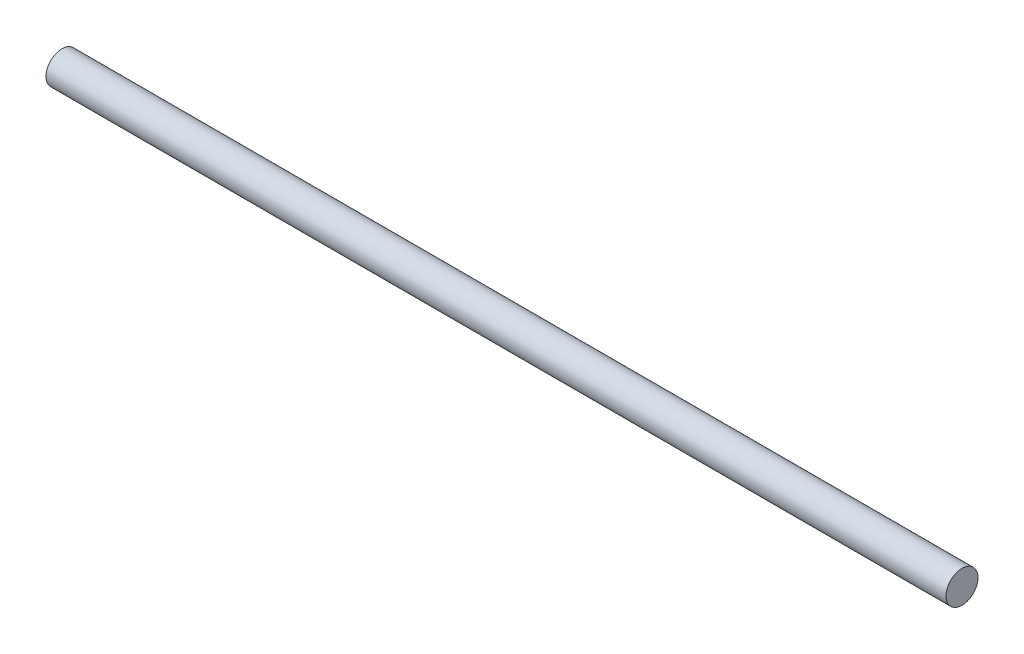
ISO-10303-21;
HEADER;
FILE_DESCRIPTION(('STEP AP214'),'2;1');
FILE_NAME('part.step','',(''),(''),'','','');
FILE_SCHEMA(('AUTOMOTIVE_DESIGN { 1 0 10303 214 1 1 1 1 }'));
ENDSEC;
DATA;
#1=APPLICATION_CONTEXT('core data for automotive mechanical design processes');
#2=APPLICATION_PROTOCOL_DEFINITION('international standard','automotive_design',2000,#1);
#3=PRODUCT_CONTEXT('',#1,'mechanical');
#4=PRODUCT('Part','Part','',(#3));
#5=PRODUCT_RELATED_PRODUCT_CATEGORY('part','',(#4));
#6=PRODUCT_DEFINITION_FORMATION('','',#4);
#7=PRODUCT_DEFINITION_CONTEXT('part definition',#1,'design');
#8=PRODUCT_DEFINITION('design','',#6,#7);
#9=PRODUCT_DEFINITION_SHAPE('','',#8);
#10=(LENGTH_UNIT() NAMED_UNIT(*) SI_UNIT(.MILLI.,.METRE.));
#11=(NAMED_UNIT(*) PLANE_ANGLE_UNIT() SI_UNIT($,.RADIAN.));
#12=(NAMED_UNIT(*) SI_UNIT($,.STERADIAN.) SOLID_ANGLE_UNIT());
#13=UNCERTAINTY_MEASURE_WITH_UNIT(LENGTH_MEASURE(1.E-05),#10,'distance_accuracy_value','');
#14=(GEOMETRIC_REPRESENTATION_CONTEXT(3) GLOBAL_UNCERTAINTY_ASSIGNED_CONTEXT((#13)) GLOBAL_UNIT_ASSIGNED_CONTEXT((#10,
#11,#12)) REPRESENTATION_CONTEXT('',''));
#15=CARTESIAN_POINT('',(0.,0.,0.));
#16=DIRECTION('',(0.,0.,1.));
#17=DIRECTION('',(1.,0.,0.));
#18=AXIS2_PLACEMENT_3D('',#15,#16,#17);
#19=CARTESIAN_POINT('',(225.,-6.37141264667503,0.));
#20=DIRECTION('',(-1.,0.,0.));
#21=DIRECTION('',(0.,0.,1.));
#22=AXIS2_PLACEMENT_3D('',#19,#20,#21);
#23=CYLINDRICAL_SURFACE('',#22,4.);
#24=CARTESIAN_POINT('',(225.,-6.37141264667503,0.));
#25=DIRECTION('',(1.,0.,0.));
#26=DIRECTION('',(0.,0.,-1.));
#27=AXIS2_PLACEMENT_3D('',#24,#25,#26);
#28=CIRCLE('',#27,4.);
#29=CARTESIAN_POINT('',(225.,-6.37141264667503,-4.));
#30=VERTEX_POINT('',#29);
#31=EDGE_CURVE('E10',#30,#30,#28,.T.);
#32=ORIENTED_EDGE('',*,*,#31,.F.);
#33=EDGE_LOOP('',(#32));
#34=FACE_BOUND('',#33,.T.);
#35=CARTESIAN_POINT('',(0.,-6.37141264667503,0.));
#36=DIRECTION('',(1.,0.,0.));
#37=DIRECTION('',(0.,0.,-1.));
#38=AXIS2_PLACEMENT_3D('',#35,#36,#37);
#39=CIRCLE('',#38,4.);
#40=CARTESIAN_POINT('',(0.,-6.37141264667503,-4.));
#41=VERTEX_POINT('',#40);
#42=EDGE_CURVE('E46',#41,#41,#39,.T.);
#43=ORIENTED_EDGE('',*,*,#42,.T.);
#44=EDGE_LOOP('',(#43));
#45=FACE_BOUND('',#44,.T.);
#46=ADVANCED_FACE('F43',(#34,#45),#23,.T.);
#47=CARTESIAN_POINT('',(225.,-6.37141264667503,0.));
#48=DIRECTION('',(1.,0.,0.));
#49=DIRECTION('',(0.,0.,-1.));
#50=AXIS2_PLACEMENT_3D('',#47,#48,#49);
#51=PLANE('',#50);
#52=ORIENTED_EDGE('',*,*,#31,.T.);
#53=EDGE_LOOP('',(#52));
#54=FACE_BOUND('',#53,.T.);
#55=ADVANCED_FACE('F60',(#54),#51,.T.);
#56=CARTESIAN_POINT('',(0.,-6.37141264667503,0.));
#57=DIRECTION('',(1.,0.,0.));
#58=DIRECTION('',(0.,0.,-1.));
#59=AXIS2_PLACEMENT_3D('',#56,#57,#58);
#60=PLANE('',#59);
#61=ORIENTED_EDGE('',*,*,#42,.F.);
#62=EDGE_LOOP('',(#61));
#63=FACE_BOUND('',#62,.T.);
#64=ADVANCED_FACE('F58',(#63),#60,.F.);
#65=CLOSED_SHELL('',(#46,#55,#64));
#66=MANIFOLD_SOLID_BREP('B2',#65);
#67=ADVANCED_BREP_SHAPE_REPRESENTATION('',(#18,#66),#14);
#68=SHAPE_DEFINITION_REPRESENTATION(#9,#67);
ENDSEC;
END-ISO-10303-21;
